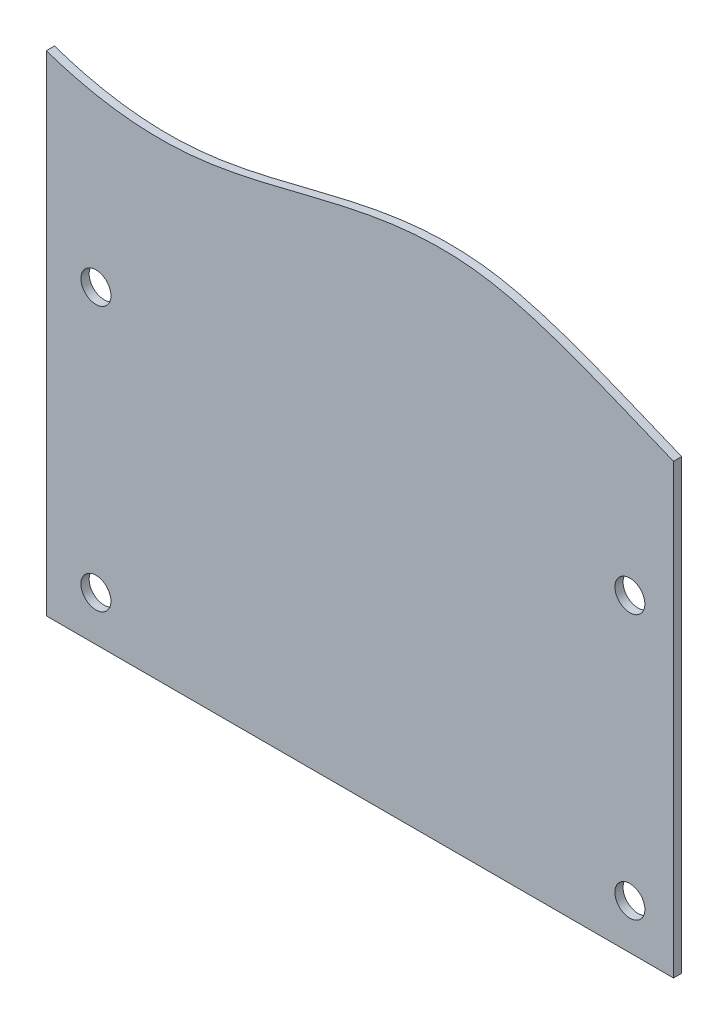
ISO-10303-21;
HEADER;
FILE_DESCRIPTION(('STEP AP214'),'2;1');
FILE_NAME('part.step','',(''),(''),'','','');
FILE_SCHEMA(('AUTOMOTIVE_DESIGN { 1 0 10303 214 1 1 1 1 }'));
ENDSEC;
DATA;
#1=APPLICATION_CONTEXT('core data for automotive mechanical design processes');
#2=APPLICATION_PROTOCOL_DEFINITION('international standard','automotive_design',2000,#1);
#3=PRODUCT_CONTEXT('',#1,'mechanical');
#4=PRODUCT('Part','Part','',(#3));
#5=PRODUCT_RELATED_PRODUCT_CATEGORY('part','',(#4));
#6=PRODUCT_DEFINITION_FORMATION('','',#4);
#7=PRODUCT_DEFINITION_CONTEXT('part definition',#1,'design');
#8=PRODUCT_DEFINITION('design','',#6,#7);
#9=PRODUCT_DEFINITION_SHAPE('','',#8);
#10=(LENGTH_UNIT() NAMED_UNIT(*) SI_UNIT(.MILLI.,.METRE.));
#11=(NAMED_UNIT(*) PLANE_ANGLE_UNIT() SI_UNIT($,.RADIAN.));
#12=(NAMED_UNIT(*) SI_UNIT($,.STERADIAN.) SOLID_ANGLE_UNIT());
#13=UNCERTAINTY_MEASURE_WITH_UNIT(LENGTH_MEASURE(1.E-05),#10,'distance_accuracy_value','');
#14=(GEOMETRIC_REPRESENTATION_CONTEXT(3) GLOBAL_UNCERTAINTY_ASSIGNED_CONTEXT((#13)) GLOBAL_UNIT_ASSIGNED_CONTEXT((#10,
#11,#12)) REPRESENTATION_CONTEXT('',''));
#15=CARTESIAN_POINT('',(0.,0.,0.));
#16=DIRECTION('',(0.,0.,1.));
#17=DIRECTION('',(1.,0.,0.));
#18=AXIS2_PLACEMENT_3D('',#15,#16,#17);
#19=CARTESIAN_POINT('',(0.,0.,3.));
#20=DIRECTION('',(-1.,0.,0.));
#21=DIRECTION('',(0.,0.,1.));
#22=AXIS2_PLACEMENT_3D('',#19,#20,#21);
#23=PLANE('',#22);
#24=DIRECTION('',(0.,1.,0.));
#25=VECTOR('',#24,1.);
#26=CARTESIAN_POINT('',(0.,0.,0.));
#27=LINE('',#26,#25);
#28=CARTESIAN_POINT('',(0.,0.,0.));
#29=VERTEX_POINT('',#28);
#30=CARTESIAN_POINT('',(0.,164.088791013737,0.));
#31=VERTEX_POINT('',#30);
#32=EDGE_CURVE('E90',#29,#31,#27,.T.);
#33=ORIENTED_EDGE('',*,*,#32,.T.);
#34=DIRECTION('',(0.,0.,-1.));
#35=VECTOR('',#34,1.);
#36=CARTESIAN_POINT('',(0.,164.088791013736,10.));
#37=LINE('',#36,#35);
#38=CARTESIAN_POINT('',(-2.8275992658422E-13,164.088791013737,3.));
#39=VERTEX_POINT('',#38);
#40=EDGE_CURVE('E45',#31,#39,#37,.F.);
#41=ORIENTED_EDGE('',*,*,#40,.T.);
#42=DIRECTION('',(0.,1.,0.));
#43=VECTOR('',#42,1.);
#44=CARTESIAN_POINT('',(0.,0.,3.));
#45=LINE('',#44,#43);
#46=CARTESIAN_POINT('',(0.,0.,3.));
#47=VERTEX_POINT('',#46);
#48=EDGE_CURVE('E92',#47,#39,#45,.T.);
#49=ORIENTED_EDGE('',*,*,#48,.F.);
#50=DIRECTION('',(0.,0.,-1.));
#51=VECTOR('',#50,1.);
#52=CARTESIAN_POINT('',(0.,0.,3.));
#53=LINE('',#52,#51);
#54=EDGE_CURVE('E38',#47,#29,#53,.T.);
#55=ORIENTED_EDGE('',*,*,#54,.T.);
#56=EDGE_LOOP('',(#33,#41,#49,#55));
#57=FACE_BOUND('',#56,.T.);
#58=ADVANCED_FACE('F31',(#57),#23,.F.);
#59=CARTESIAN_POINT('',(-230.,0.,3.));
#60=DIRECTION('',(1.,0.,0.));
#61=DIRECTION('',(0.,0.,-1.));
#62=AXIS2_PLACEMENT_3D('',#59,#60,#61);
#63=PLANE('',#62);
#64=DIRECTION('',(0.,-1.,0.));
#65=VECTOR('',#64,1.);
#66=CARTESIAN_POINT('',(-230.,0.,3.));
#67=LINE('',#66,#65);
#68=CARTESIAN_POINT('',(-230.,179.486602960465,3.));
#69=VERTEX_POINT('',#68);
#70=CARTESIAN_POINT('',(-230.,0.,3.));
#71=VERTEX_POINT('',#70);
#72=EDGE_CURVE('E85',#69,#71,#67,.T.);
#73=ORIENTED_EDGE('',*,*,#72,.F.);
#74=DIRECTION('',(0.,0.,-1.));
#75=VECTOR('',#74,1.);
#76=CARTESIAN_POINT('',(-230.,179.486602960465,10.));
#77=LINE('',#76,#75);
#78=CARTESIAN_POINT('',(-230.,179.486602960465,0.));
#79=VERTEX_POINT('',#78);
#80=EDGE_CURVE('E72',#69,#79,#77,.T.);
#81=ORIENTED_EDGE('',*,*,#80,.T.);
#82=DIRECTION('',(0.,-1.,0.));
#83=VECTOR('',#82,1.);
#84=CARTESIAN_POINT('',(-230.,0.,0.));
#85=LINE('',#84,#83);
#86=CARTESIAN_POINT('',(-230.,0.,0.));
#87=VERTEX_POINT('',#86);
#88=EDGE_CURVE('E84',#79,#87,#85,.T.);
#89=ORIENTED_EDGE('',*,*,#88,.T.);
#90=DIRECTION('',(0.,0.,-1.));
#91=VECTOR('',#90,1.);
#92=CARTESIAN_POINT('',(-230.,0.,3.));
#93=LINE('',#92,#91);
#94=EDGE_CURVE('E11',#71,#87,#93,.T.);
#95=ORIENTED_EDGE('',*,*,#94,.F.);
#96=EDGE_LOOP('',(#73,#81,#89,#95));
#97=FACE_BOUND('',#96,.T.);
#98=ADVANCED_FACE('F82',(#97),#63,.F.);
#99=CARTESIAN_POINT('',(0.,0.,3.));
#100=DIRECTION('',(0.,1.,0.));
#101=DIRECTION('',(-1.,0.,0.));
#102=AXIS2_PLACEMENT_3D('',#99,#100,#101);
#103=PLANE('',#102);
#104=DIRECTION('',(1.,0.,0.));
#105=VECTOR('',#104,1.);
#106=CARTESIAN_POINT('',(0.,0.,0.));
#107=LINE('',#106,#105);
#108=EDGE_CURVE('E89',#87,#29,#107,.T.);
#109=ORIENTED_EDGE('',*,*,#108,.T.);
#110=ORIENTED_EDGE('',*,*,#54,.F.);
#111=DIRECTION('',(1.,0.,0.));
#112=VECTOR('',#111,1.);
#113=CARTESIAN_POINT('',(0.,0.,3.));
#114=LINE('',#113,#112);
#115=EDGE_CURVE('E53',#71,#47,#114,.T.);
#116=ORIENTED_EDGE('',*,*,#115,.F.);
#117=ORIENTED_EDGE('',*,*,#94,.T.);
#118=EDGE_LOOP('',(#109,#110,#116,#117));
#119=FACE_BOUND('',#118,.T.);
#120=ADVANCED_FACE('F104',(#119),#103,.F.);
#121=CARTESIAN_POINT('',(0.,0.,3.));
#122=DIRECTION('',(0.,0.,1.));
#123=DIRECTION('',(1.,0.,0.));
#124=AXIS2_PLACEMENT_3D('',#121,#122,#123);
#125=PLANE('',#124);
#126=CARTESIAN_POINT('',(48.9872587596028,156.702267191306,3.));
#127=CARTESIAN_POINT('',(24.0152245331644,144.786440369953,3.));
#128=CARTESIAN_POINT('',(-69.6266027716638,213.580453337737,3.));
#129=CARTESIAN_POINT('',(-158.379706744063,167.448502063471,3.));
#130=CARTESIAN_POINT('',(-243.233726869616,176.535771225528,3.));
#131=CARTESIAN_POINT('',(-333.391318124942,241.115847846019,3.));
#132=CARTESIAN_POINT('',(-215.593643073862,361.970685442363,3.));
#133=CARTESIAN_POINT('',(-102.268187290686,312.435660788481,3.));
#134=CARTESIAN_POINT('',(2.04076556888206,347.651654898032,3.));
#135=CARTESIAN_POINT('',(71.0185337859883,286.923763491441,3.));
#136=CARTESIAN_POINT('',(79.7919812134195,171.401259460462,3.));
#137=CARTESIAN_POINT('',(48.9872587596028,156.702267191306,3.));
#138=B_SPLINE_CURVE_WITH_KNOTS('',3,(#126,#127,#128,#129,#130,#131,#132,#133,#134,#135,#136,
#137),.UNSPECIFIED.,.T.,.F.,(4,1,1,1,1,1,1,1,1,4),(0.,0.13266903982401,0.25035523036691,
0.308940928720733,0.414317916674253,0.513574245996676,0.715334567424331,0.785901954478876,
0.836343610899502,1.),.UNSPECIFIED.);
#139=EDGE_CURVE('E78',#69,#39,#138,.F.);
#140=ORIENTED_EDGE('',*,*,#139,.F.);
#141=ORIENTED_EDGE('',*,*,#72,.T.);
#142=ORIENTED_EDGE('',*,*,#115,.T.);
#143=ORIENTED_EDGE('',*,*,#48,.T.);
#144=EDGE_LOOP('',(#140,#141,#142,#143));
#145=FACE_BOUND('',#144,.T.);
#146=CARTESIAN_POINT('',(-211.8,16.5,3.));
#147=DIRECTION('',(0.,0.,1.));
#148=DIRECTION('',(1.,0.,0.));
#149=AXIS2_PLACEMENT_3D('',#146,#147,#148);
#150=CIRCLE('',#149,5.50000000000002);
#151=CARTESIAN_POINT('',(-206.3,16.5,3.));
#152=VERTEX_POINT('',#151);
#153=EDGE_CURVE('E210',#152,#152,#150,.T.);
#154=ORIENTED_EDGE('',*,*,#153,.F.);
#155=EDGE_LOOP('',(#154));
#156=FACE_BOUND('',#155,.T.);
#157=CARTESIAN_POINT('',(-211.8,113.5,3.));
#158=DIRECTION('',(0.,0.,1.));
#159=DIRECTION('',(1.,0.,0.));
#160=AXIS2_PLACEMENT_3D('',#157,#158,#159);
#161=CIRCLE('',#160,5.50000000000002);
#162=CARTESIAN_POINT('',(-206.3,113.5,3.));
#163=VERTEX_POINT('',#162);
#164=EDGE_CURVE('E216',#163,#163,#161,.T.);
#165=ORIENTED_EDGE('',*,*,#164,.F.);
#166=EDGE_LOOP('',(#165));
#167=FACE_BOUND('',#166,.T.);
#168=CARTESIAN_POINT('',(-16.,113.5,3.));
#169=DIRECTION('',(0.,0.,1.));
#170=DIRECTION('',(1.,0.,0.));
#171=AXIS2_PLACEMENT_3D('',#168,#169,#170);
#172=CIRCLE('',#171,5.5);
#173=CARTESIAN_POINT('',(-10.5,113.5,3.));
#174=VERTEX_POINT('',#173);
#175=EDGE_CURVE('E222',#174,#174,#172,.T.);
#176=ORIENTED_EDGE('',*,*,#175,.F.);
#177=EDGE_LOOP('',(#176));
#178=FACE_BOUND('',#177,.T.);
#179=CARTESIAN_POINT('',(-16.,16.5,3.));
#180=DIRECTION('',(0.,0.,1.));
#181=DIRECTION('',(1.,0.,0.));
#182=AXIS2_PLACEMENT_3D('',#179,#180,#181);
#183=CIRCLE('',#182,5.5);
#184=CARTESIAN_POINT('',(-10.5,16.5,3.));
#185=VERTEX_POINT('',#184);
#186=EDGE_CURVE('E228',#185,#185,#183,.T.);
#187=ORIENTED_EDGE('',*,*,#186,.F.);
#188=EDGE_LOOP('',(#187));
#189=FACE_BOUND('',#188,.T.);
#190=ADVANCED_FACE('F106',(#145,#156,#167,#178,#189),#125,.T.);
#191=CARTESIAN_POINT('',(0.,0.,0.));
#192=DIRECTION('',(0.,0.,1.));
#193=DIRECTION('',(1.,0.,0.));
#194=AXIS2_PLACEMENT_3D('',#191,#192,#193);
#195=PLANE('',#194);
#196=CARTESIAN_POINT('',(-211.8,16.5,0.));
#197=DIRECTION('',(0.,0.,1.));
#198=DIRECTION('',(1.,0.,0.));
#199=AXIS2_PLACEMENT_3D('',#196,#197,#198);
#200=CIRCLE('',#199,5.50000000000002);
#201=CARTESIAN_POINT('',(-206.3,16.5,0.));
#202=VERTEX_POINT('',#201);
#203=EDGE_CURVE('E213',#202,#202,#200,.T.);
#204=ORIENTED_EDGE('',*,*,#203,.T.);
#205=EDGE_LOOP('',(#204));
#206=FACE_BOUND('',#205,.T.);
#207=CARTESIAN_POINT('',(-211.8,113.5,0.));
#208=DIRECTION('',(0.,0.,1.));
#209=DIRECTION('',(1.,0.,0.));
#210=AXIS2_PLACEMENT_3D('',#207,#208,#209);
#211=CIRCLE('',#210,5.50000000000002);
#212=CARTESIAN_POINT('',(-206.3,113.5,0.));
#213=VERTEX_POINT('',#212);
#214=EDGE_CURVE('E219',#213,#213,#211,.T.);
#215=ORIENTED_EDGE('',*,*,#214,.T.);
#216=EDGE_LOOP('',(#215));
#217=FACE_BOUND('',#216,.T.);
#218=CARTESIAN_POINT('',(-16.,113.5,0.));
#219=DIRECTION('',(0.,0.,1.));
#220=DIRECTION('',(1.,0.,0.));
#221=AXIS2_PLACEMENT_3D('',#218,#219,#220);
#222=CIRCLE('',#221,5.5);
#223=CARTESIAN_POINT('',(-10.5,113.5,0.));
#224=VERTEX_POINT('',#223);
#225=EDGE_CURVE('E225',#224,#224,#222,.T.);
#226=ORIENTED_EDGE('',*,*,#225,.T.);
#227=EDGE_LOOP('',(#226));
#228=FACE_BOUND('',#227,.T.);
#229=CARTESIAN_POINT('',(-16.,16.5,0.));
#230=DIRECTION('',(0.,0.,1.));
#231=DIRECTION('',(1.,0.,0.));
#232=AXIS2_PLACEMENT_3D('',#229,#230,#231);
#233=CIRCLE('',#232,5.5);
#234=CARTESIAN_POINT('',(-10.5,16.5,0.));
#235=VERTEX_POINT('',#234);
#236=EDGE_CURVE('E94',#235,#235,#233,.T.);
#237=ORIENTED_EDGE('',*,*,#236,.T.);
#238=EDGE_LOOP('',(#237));
#239=FACE_BOUND('',#238,.T.);
#240=ORIENTED_EDGE('',*,*,#88,.F.);
#241=CARTESIAN_POINT('',(48.9872587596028,156.702267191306,0.));
#242=CARTESIAN_POINT('',(24.0152245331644,144.786440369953,0.));
#243=CARTESIAN_POINT('',(-69.6266027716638,213.580453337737,0.));
#244=CARTESIAN_POINT('',(-158.379706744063,167.448502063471,0.));
#245=CARTESIAN_POINT('',(-243.233726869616,176.535771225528,0.));
#246=CARTESIAN_POINT('',(-333.391318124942,241.115847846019,0.));
#247=CARTESIAN_POINT('',(-215.593643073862,361.970685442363,0.));
#248=CARTESIAN_POINT('',(-102.268187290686,312.435660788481,0.));
#249=CARTESIAN_POINT('',(2.04076556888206,347.651654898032,0.));
#250=CARTESIAN_POINT('',(71.0185337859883,286.923763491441,0.));
#251=CARTESIAN_POINT('',(79.7919812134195,171.401259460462,0.));
#252=CARTESIAN_POINT('',(48.9872587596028,156.702267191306,0.));
#253=B_SPLINE_CURVE_WITH_KNOTS('',3,(#241,#242,#243,#244,#245,#246,#247,#248,#249,#250,#251,
#252),.UNSPECIFIED.,.T.,.F.,(4,1,1,1,1,1,1,1,1,4),(0.,0.13266903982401,0.25035523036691,
0.308940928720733,0.414317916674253,0.513574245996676,0.715334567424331,0.785901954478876,
0.836343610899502,1.),.UNSPECIFIED.);
#254=EDGE_CURVE('E69',#31,#79,#253,.T.);
#255=ORIENTED_EDGE('',*,*,#254,.F.);
#256=ORIENTED_EDGE('',*,*,#32,.F.);
#257=ORIENTED_EDGE('',*,*,#108,.F.);
#258=EDGE_LOOP('',(#240,#255,#256,#257));
#259=FACE_BOUND('',#258,.T.);
#260=ADVANCED_FACE('F88',(#206,#217,#228,#239,#259),#195,.F.);
#261=CARTESIAN_POINT('',(-16.,16.5,0.));
#262=DIRECTION('',(0.,0.,1.));
#263=DIRECTION('',(1.,0.,0.));
#264=AXIS2_PLACEMENT_3D('',#261,#262,#263);
#265=CYLINDRICAL_SURFACE('',#264,5.5);
#266=ORIENTED_EDGE('',*,*,#236,.F.);
#267=EDGE_LOOP('',(#266));
#268=FACE_BOUND('',#267,.T.);
#269=ORIENTED_EDGE('',*,*,#186,.T.);
#270=EDGE_LOOP('',(#269));
#271=FACE_BOUND('',#270,.T.);
#272=ADVANCED_FACE('F137',(#268,#271),#265,.F.);
#273=CARTESIAN_POINT('',(-16.,113.5,0.));
#274=DIRECTION('',(0.,0.,1.));
#275=DIRECTION('',(1.,0.,0.));
#276=AXIS2_PLACEMENT_3D('',#273,#274,#275);
#277=CYLINDRICAL_SURFACE('',#276,5.5);
#278=ORIENTED_EDGE('',*,*,#225,.F.);
#279=EDGE_LOOP('',(#278));
#280=FACE_BOUND('',#279,.T.);
#281=ORIENTED_EDGE('',*,*,#175,.T.);
#282=EDGE_LOOP('',(#281));
#283=FACE_BOUND('',#282,.T.);
#284=ADVANCED_FACE('F164',(#280,#283),#277,.F.);
#285=CARTESIAN_POINT('',(-211.8,113.5,0.));
#286=DIRECTION('',(0.,0.,1.));
#287=DIRECTION('',(1.,0.,0.));
#288=AXIS2_PLACEMENT_3D('',#285,#286,#287);
#289=CYLINDRICAL_SURFACE('',#288,5.50000000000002);
#290=ORIENTED_EDGE('',*,*,#214,.F.);
#291=EDGE_LOOP('',(#290));
#292=FACE_BOUND('',#291,.T.);
#293=ORIENTED_EDGE('',*,*,#164,.T.);
#294=EDGE_LOOP('',(#293));
#295=FACE_BOUND('',#294,.T.);
#296=ADVANCED_FACE('F157',(#292,#295),#289,.F.);
#297=CARTESIAN_POINT('',(-211.8,16.5,0.));
#298=DIRECTION('',(0.,0.,1.));
#299=DIRECTION('',(1.,0.,0.));
#300=AXIS2_PLACEMENT_3D('',#297,#298,#299);
#301=CYLINDRICAL_SURFACE('',#300,5.50000000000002);
#302=ORIENTED_EDGE('',*,*,#203,.F.);
#303=EDGE_LOOP('',(#302));
#304=FACE_BOUND('',#303,.T.);
#305=ORIENTED_EDGE('',*,*,#153,.T.);
#306=EDGE_LOOP('',(#305));
#307=FACE_BOUND('',#306,.T.);
#308=ADVANCED_FACE('F148',(#304,#307),#301,.F.);
#309=CARTESIAN_POINT('',(48.9872587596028,156.702267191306,10.));
#310=CARTESIAN_POINT('',(24.0152245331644,144.786440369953,10.));
#311=CARTESIAN_POINT('',(-69.6266027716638,213.580453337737,10.));
#312=CARTESIAN_POINT('',(-158.379706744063,167.448502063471,10.));
#313=CARTESIAN_POINT('',(-243.233726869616,176.535771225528,10.));
#314=CARTESIAN_POINT('',(-333.391318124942,241.115847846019,10.));
#315=CARTESIAN_POINT('',(-215.593643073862,361.970685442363,10.));
#316=CARTESIAN_POINT('',(-102.268187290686,312.435660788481,10.));
#317=CARTESIAN_POINT('',(2.04076556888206,347.651654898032,10.));
#318=CARTESIAN_POINT('',(71.0185337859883,286.923763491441,10.));
#319=CARTESIAN_POINT('',(79.7919812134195,171.401259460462,10.));
#320=CARTESIAN_POINT('',(48.9872587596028,156.702267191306,10.));
#321=B_SPLINE_CURVE_WITH_KNOTS('',3,(#309,#310,#311,#312,#313,#314,#315,#316,#317,#318,#319,
#320),.UNSPECIFIED.,.T.,.F.,(4,1,1,1,1,1,1,1,1,4),(0.,0.13266903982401,0.25035523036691,
0.308940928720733,0.414317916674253,0.513574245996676,0.715334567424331,0.785901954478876,
0.836343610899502,1.),.UNSPECIFIED.);
#322=DIRECTION('',(0.,0.,-1.));
#323=VECTOR('',#322,1.);
#324=SURFACE_OF_LINEAR_EXTRUSION('',#321,#323);
#325=ORIENTED_EDGE('',*,*,#254,.T.);
#326=ORIENTED_EDGE('',*,*,#80,.F.);
#327=ORIENTED_EDGE('',*,*,#139,.T.);
#328=ORIENTED_EDGE('',*,*,#40,.F.);
#329=EDGE_LOOP('',(#325,#326,#327,#328));
#330=FACE_BOUND('',#329,.T.);
#331=ADVANCED_FACE('F71',(#330),#324,.F.);
#332=CLOSED_SHELL('',(#58,#98,#120,#190,#260,#272,#284,#296,#308,#331));
#333=MANIFOLD_SOLID_BREP('B2',#332);
#334=ADVANCED_BREP_SHAPE_REPRESENTATION('',(#18,#333),#14);
#335=SHAPE_DEFINITION_REPRESENTATION(#9,#334);
ENDSEC;
END-ISO-10303-21;
